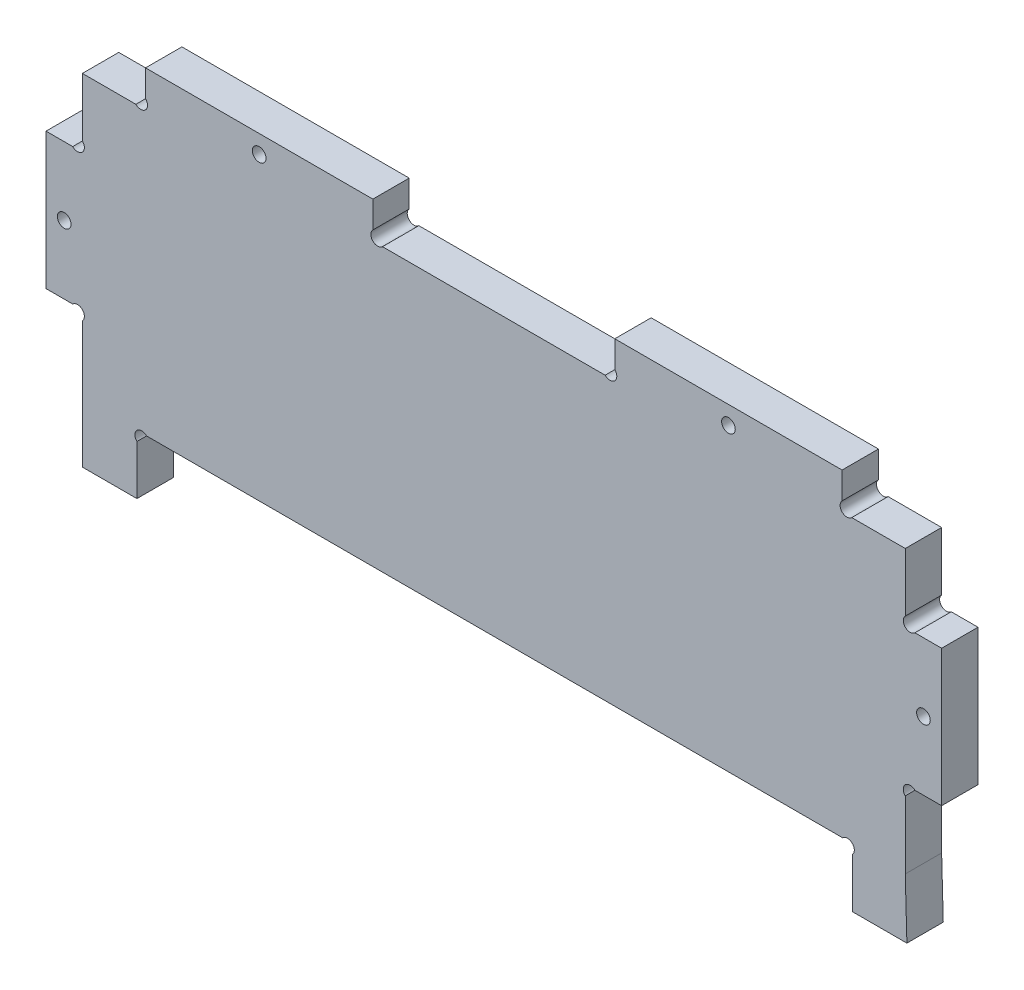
ISO-10303-21;
HEADER;
FILE_DESCRIPTION(('STEP AP214'),'2;1');
FILE_NAME('part.step','',(''),(''),'','','');
FILE_SCHEMA(('AUTOMOTIVE_DESIGN { 1 0 10303 214 1 1 1 1 }'));
ENDSEC;
DATA;
#1=APPLICATION_CONTEXT('core data for automotive mechanical design processes');
#2=APPLICATION_PROTOCOL_DEFINITION('international standard','automotive_design',2000,#1);
#3=PRODUCT_CONTEXT('',#1,'mechanical');
#4=PRODUCT('Part','Part','',(#3));
#5=PRODUCT_RELATED_PRODUCT_CATEGORY('part','',(#4));
#6=PRODUCT_DEFINITION_FORMATION('','',#4);
#7=PRODUCT_DEFINITION_CONTEXT('part definition',#1,'design');
#8=PRODUCT_DEFINITION('design','',#6,#7);
#9=PRODUCT_DEFINITION_SHAPE('','',#8);
#10=(LENGTH_UNIT() NAMED_UNIT(*) SI_UNIT(.MILLI.,.METRE.));
#11=(NAMED_UNIT(*) PLANE_ANGLE_UNIT() SI_UNIT($,.RADIAN.));
#12=(NAMED_UNIT(*) SI_UNIT($,.STERADIAN.) SOLID_ANGLE_UNIT());
#13=UNCERTAINTY_MEASURE_WITH_UNIT(LENGTH_MEASURE(1.E-05),#10,'distance_accuracy_value','');
#14=(GEOMETRIC_REPRESENTATION_CONTEXT(3) GLOBAL_UNCERTAINTY_ASSIGNED_CONTEXT((#13)) GLOBAL_UNIT_ASSIGNED_CONTEXT((#10,
#11,#12)) REPRESENTATION_CONTEXT('',''));
#15=CARTESIAN_POINT('',(0.,0.,0.));
#16=DIRECTION('',(0.,0.,1.));
#17=DIRECTION('',(1.,0.,0.));
#18=AXIS2_PLACEMENT_3D('',#15,#16,#17);
#19=CARTESIAN_POINT('',(136.240627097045,-37.5973711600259,8.));
#20=DIRECTION('',(0.,0.,1.));
#21=DIRECTION('',(1.,0.,0.));
#22=AXIS2_PLACEMENT_3D('',#19,#20,#21);
#23=PLANE('',#22);
#24=CARTESIAN_POINT('',(152.942499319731,-4.53671095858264,8.));
#25=DIRECTION('',(0.,0.,1.));
#26=DIRECTION('',(1.,0.,0.));
#27=AXIS2_PLACEMENT_3D('',#24,#25,#26);
#28=CIRCLE('',#27,1.49999999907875);
#29=CARTESIAN_POINT('',(154.442499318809,-4.53671095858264,8.));
#30=VERTEX_POINT('',#29);
#31=EDGE_CURVE('E590',#30,#30,#28,.T.);
#32=ORIENTED_EDGE('',*,*,#31,.F.);
#33=EDGE_LOOP('',(#32));
#34=FACE_BOUND('',#33,.T.);
#35=CARTESIAN_POINT('',(6.83564145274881,29.4632890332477,8.));
#36=DIRECTION('',(0.,0.,1.));
#37=DIRECTION('',(1.,0.,0.));
#38=AXIS2_PLACEMENT_3D('',#35,#36,#37);
#39=CIRCLE('',#38,1.5);
#40=CARTESIAN_POINT('',(8.33564145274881,29.4632890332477,8.));
#41=VERTEX_POINT('',#40);
#42=EDGE_CURVE('E295',#41,#41,#39,.T.);
#43=ORIENTED_EDGE('',*,*,#42,.F.);
#44=EDGE_LOOP('',(#43));
#45=FACE_BOUND('',#44,.T.);
#46=CARTESIAN_POINT('',(136.240627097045,-37.5973711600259,8.));
#47=DIRECTION('',(0.,0.,-1.));
#48=DIRECTION('',(1.,0.,0.));
#49=AXIS2_PLACEMENT_3D('',#46,#47,#48);
#50=CIRCLE('',#49,1.50000000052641);
#51=CARTESIAN_POINT('',(135.179966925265,-36.5367109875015,8.));
#52=VERTEX_POINT('',#51);
#53=CARTESIAN_POINT('',(137.301287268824,-38.6580313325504,8.));
#54=VERTEX_POINT('',#53);
#55=EDGE_CURVE('E361',#52,#54,#50,.T.);
#56=ORIENTED_EDGE('',*,*,#55,.T.);
#57=DIRECTION('',(0.,-1.,0.));
#58=VECTOR('',#57,1.);
#59=CARTESIAN_POINT('',(137.301287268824,-49.5367110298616,8.));
#60=LINE('',#59,#58);
#61=CARTESIAN_POINT('',(137.301287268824,-49.5367110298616,8.));
#62=VERTEX_POINT('',#61);
#63=EDGE_CURVE('E173',#54,#62,#60,.T.);
#64=ORIENTED_EDGE('',*,*,#63,.T.);
#65=DIRECTION('',(1.,0.,0.));
#66=VECTOR('',#65,1.);
#67=CARTESIAN_POINT('',(149.301287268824,-49.5367110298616,8.));
#68=LINE('',#67,#66);
#69=CARTESIAN_POINT('',(149.301287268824,-49.5367110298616,8.));
#70=VERTEX_POINT('',#69);
#71=EDGE_CURVE('E457',#62,#70,#68,.T.);
#72=ORIENTED_EDGE('',*,*,#71,.T.);
#73=DIRECTION('',(-0.0275885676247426,0.999619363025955,0.));
#74=VECTOR('',#73,1.);
#75=CARTESIAN_POINT('',(148.942499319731,-36.5367109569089,8.));
#76=LINE('',#75,#74);
#77=CARTESIAN_POINT('',(148.942499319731,-36.5367109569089,8.));
#78=VERTEX_POINT('',#77);
#79=EDGE_CURVE('E476',#70,#78,#76,.T.);
#80=ORIENTED_EDGE('',*,*,#79,.T.);
#81=DIRECTION('',(0.,1.,0.));
#82=VECTOR('',#81,1.);
#83=CARTESIAN_POINT('',(148.942499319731,-21.6580313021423,8.));
#84=LINE('',#83,#82);
#85=CARTESIAN_POINT('',(148.942499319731,-21.6580313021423,8.));
#86=VERTEX_POINT('',#85);
#87=EDGE_CURVE('E473',#78,#86,#84,.T.);
#88=ORIENTED_EDGE('',*,*,#87,.T.);
#89=CARTESIAN_POINT('',(150.003159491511,-20.5973711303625,8.));
#90=DIRECTION('',(0.,0.,-1.));
#91=DIRECTION('',(1.,0.,0.));
#92=AXIS2_PLACEMENT_3D('',#89,#90,#91);
#93=CIRCLE('',#92,1.50000000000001);
#94=CARTESIAN_POINT('',(151.06381966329,-19.5367109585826,8.));
#95=VERTEX_POINT('',#94);
#96=EDGE_CURVE('E475',#86,#95,#93,.T.);
#97=ORIENTED_EDGE('',*,*,#96,.T.);
#98=DIRECTION('',(1.,0.,0.));
#99=VECTOR('',#98,1.);
#100=CARTESIAN_POINT('',(156.942499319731,-19.5367109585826,8.));
#101=LINE('',#100,#99);
#102=CARTESIAN_POINT('',(156.942499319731,-19.5367109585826,8.));
#103=VERTEX_POINT('',#102);
#104=EDGE_CURVE('E478',#95,#103,#101,.T.);
#105=ORIENTED_EDGE('',*,*,#104,.T.);
#106=DIRECTION('',(0.,1.,0.));
#107=VECTOR('',#106,1.);
#108=CARTESIAN_POINT('',(156.942499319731,10.4632890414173,8.));
#109=LINE('',#108,#107);
#110=CARTESIAN_POINT('',(156.942499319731,10.4632890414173,8.));
#111=VERTEX_POINT('',#110);
#112=EDGE_CURVE('E484',#103,#111,#109,.T.);
#113=ORIENTED_EDGE('',*,*,#112,.T.);
#114=DIRECTION('',(-1.,0.,0.));
#115=VECTOR('',#114,1.);
#116=CARTESIAN_POINT('',(151.063819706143,10.4632890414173,8.));
#117=LINE('',#116,#115);
#118=CARTESIAN_POINT('',(151.063819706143,10.4632890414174,8.));
#119=VERTEX_POINT('',#118);
#120=EDGE_CURVE('E486',#111,#119,#117,.T.);
#121=ORIENTED_EDGE('',*,*,#120,.T.);
#122=CARTESIAN_POINT('',(150.003159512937,11.5239492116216,8.));
#123=DIRECTION('',(0.,0.,-1.));
#124=DIRECTION('',(1.,0.,0.));
#125=AXIS2_PLACEMENT_3D('',#122,#123,#124);
#126=CIRCLE('',#125,1.50000001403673);
#127=CARTESIAN_POINT('',(148.942499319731,12.5846093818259,8.));
#128=VERTEX_POINT('',#127);
#129=EDGE_CURVE('E488',#119,#128,#126,.T.);
#130=ORIENTED_EDGE('',*,*,#129,.T.);
#131=DIRECTION('',(0.,1.,0.));
#132=VECTOR('',#131,1.);
#133=CARTESIAN_POINT('',(148.942499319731,25.4632890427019,8.));
#134=LINE('',#133,#132);
#135=CARTESIAN_POINT('',(148.942499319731,25.4632890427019,8.));
#136=VERTEX_POINT('',#135);
#137=EDGE_CURVE('E490',#128,#136,#134,.T.);
#138=ORIENTED_EDGE('',*,*,#137,.T.);
#139=DIRECTION('',(-1.,0.,0.));
#140=VECTOR('',#139,1.);
#141=CARTESIAN_POINT('',(148.942499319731,25.4632890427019,8.));
#142=LINE('',#141,#140);
#143=CARTESIAN_POINT('',(137.170721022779,25.4632890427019,8.));
#144=VERTEX_POINT('',#143);
#145=EDGE_CURVE('E492',#136,#144,#142,.T.);
#146=ORIENTED_EDGE('',*,*,#145,.T.);
#147=CARTESIAN_POINT('',(136.110060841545,26.5239492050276,8.));
#148=DIRECTION('',(0.,0.,-1.));
#149=DIRECTION('',(1.,0.,0.));
#150=AXIS2_PLACEMENT_3D('',#147,#148,#149);
#151=CIRCLE('',#150,1.5);
#152=CARTESIAN_POINT('',(135.049400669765,27.5846093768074,8.));
#153=VERTEX_POINT('',#152);
#154=EDGE_CURVE('E494',#144,#153,#151,.T.);
#155=ORIENTED_EDGE('',*,*,#154,.T.);
#156=DIRECTION('',(0.,1.,0.));
#157=VECTOR('',#156,1.);
#158=CARTESIAN_POINT('',(135.049400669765,27.5846093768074,8.));
#159=LINE('',#158,#157);
#160=CARTESIAN_POINT('',(135.049400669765,33.4632890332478,8.));
#161=VERTEX_POINT('',#160);
#162=EDGE_CURVE('E496',#153,#161,#159,.T.);
#163=ORIENTED_EDGE('',*,*,#162,.T.);
#164=DIRECTION('',(-1.,0.,0.));
#165=VECTOR('',#164,1.);
#166=CARTESIAN_POINT('',(135.049400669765,33.4632890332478,8.));
#167=LINE('',#166,#165);
#168=CARTESIAN_POINT('',(85.0493167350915,33.4632890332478,8.));
#169=VERTEX_POINT('',#168);
#170=EDGE_CURVE('E498',#161,#169,#167,.T.);
#171=ORIENTED_EDGE('',*,*,#170,.T.);
#172=DIRECTION('',(0.,-1.,0.));
#173=VECTOR('',#172,1.);
#174=CARTESIAN_POINT('',(85.0493167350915,33.4632890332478,8.));
#175=LINE('',#174,#173);
#176=CARTESIAN_POINT('',(85.0493167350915,27.5846093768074,8.));
#177=VERTEX_POINT('',#176);
#178=EDGE_CURVE('E500',#169,#177,#175,.T.);
#179=ORIENTED_EDGE('',*,*,#178,.T.);
#180=CARTESIAN_POINT('',(83.9886565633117,26.5239492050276,8.));
#181=DIRECTION('',(0.,0.,-1.));
#182=DIRECTION('',(1.,0.,0.));
#183=AXIS2_PLACEMENT_3D('',#180,#181,#182);
#184=CIRCLE('',#183,1.5);
#185=CARTESIAN_POINT('',(82.9279963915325,25.4632890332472,8.));
#186=VERTEX_POINT('',#185);
#187=EDGE_CURVE('E502',#177,#186,#184,.T.);
#188=ORIENTED_EDGE('',*,*,#187,.T.);
#189=DIRECTION('',(-1.,0.,0.));
#190=VECTOR('',#189,1.);
#191=CARTESIAN_POINT('',(82.9279963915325,25.4632890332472,8.));
#192=LINE('',#191,#190);
#193=CARTESIAN_POINT('',(33.9570037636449,25.4632890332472,8.));
#194=VERTEX_POINT('',#193);
#195=EDGE_CURVE('E504',#186,#194,#192,.T.);
#196=ORIENTED_EDGE('',*,*,#195,.T.);
#197=CARTESIAN_POINT('',(32.8963435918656,26.5239492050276,8.));
#198=DIRECTION('',(0.,0.,-1.));
#199=DIRECTION('',(1.,0.,0.));
#200=AXIS2_PLACEMENT_3D('',#197,#198,#199);
#201=CIRCLE('',#200,1.50000000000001);
#202=CARTESIAN_POINT('',(31.8356834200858,27.5846093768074,8.));
#203=VERTEX_POINT('',#202);
#204=EDGE_CURVE('E506',#194,#203,#201,.T.);
#205=ORIENTED_EDGE('',*,*,#204,.T.);
#206=DIRECTION('',(0.,1.,0.));
#207=VECTOR('',#206,1.);
#208=CARTESIAN_POINT('',(31.8356834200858,27.5846093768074,8.));
#209=LINE('',#208,#207);
#210=CARTESIAN_POINT('',(31.8356834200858,33.4632890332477,8.));
#211=VERTEX_POINT('',#210);
#212=EDGE_CURVE('E508',#203,#211,#209,.T.);
#213=ORIENTED_EDGE('',*,*,#212,.T.);
#214=DIRECTION('',(-1.,0.,0.));
#215=VECTOR('',#214,1.);
#216=CARTESIAN_POINT('',(31.8356834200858,33.4632890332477,8.));
#217=LINE('',#216,#215);
#218=CARTESIAN_POINT('',(-18.1644005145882,33.4632890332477,8.));
#219=VERTEX_POINT('',#218);
#220=EDGE_CURVE('E510',#211,#219,#217,.T.);
#221=ORIENTED_EDGE('',*,*,#220,.T.);
#222=DIRECTION('',(0.,-1.,0.));
#223=VECTOR('',#222,1.);
#224=CARTESIAN_POINT('',(-18.1644005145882,33.4632890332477,8.));
#225=LINE('',#224,#223);
#226=CARTESIAN_POINT('',(-18.1644005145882,27.5846093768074,8.));
#227=VERTEX_POINT('',#226);
#228=EDGE_CURVE('E512',#219,#227,#225,.T.);
#229=ORIENTED_EDGE('',*,*,#228,.T.);
#230=CARTESIAN_POINT('',(-19.225060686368,26.5239492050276,8.));
#231=DIRECTION('',(0.,0.,-1.));
#232=DIRECTION('',(1.,0.,0.));
#233=AXIS2_PLACEMENT_3D('',#230,#231,#232);
#234=CIRCLE('',#233,1.5);
#235=CARTESIAN_POINT('',(-20.2857208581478,25.4632890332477,8.));
#236=VERTEX_POINT('',#235);
#237=EDGE_CURVE('E514',#227,#236,#234,.T.);
#238=ORIENTED_EDGE('',*,*,#237,.T.);
#239=DIRECTION('',(-1.,1.24144096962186E-10,0.));
#240=VECTOR('',#239,1.);
#241=CARTESIAN_POINT('',(-20.2857208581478,25.4632890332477,8.));
#242=LINE('',#241,#240);
#243=CARTESIAN_POINT('',(-32.0575006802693,25.4632890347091,8.));
#244=VERTEX_POINT('',#243);
#245=EDGE_CURVE('E516',#236,#244,#242,.T.);
#246=ORIENTED_EDGE('',*,*,#245,.T.);
#247=DIRECTION('',(0.,-1.,0.));
#248=VECTOR('',#247,1.);
#249=CARTESIAN_POINT('',(-32.0575006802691,12.5846093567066,8.));
#250=LINE('',#249,#248);
#251=CARTESIAN_POINT('',(-32.0575006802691,12.5846093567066,8.));
#252=VERTEX_POINT('',#251);
#253=EDGE_CURVE('E518',#244,#252,#250,.T.);
#254=ORIENTED_EDGE('',*,*,#253,.T.);
#255=CARTESIAN_POINT('',(-33.1181608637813,11.523949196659,8.));
#256=DIRECTION('',(0.,0.,-1.));
#257=DIRECTION('',(1.,0.,0.));
#258=AXIS2_PLACEMENT_3D('',#255,#256,#257);
#259=CIRCLE('',#258,1.50000000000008);
#260=CARTESIAN_POINT('',(-34.1788210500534,10.4632890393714,8.));
#261=VERTEX_POINT('',#260);
#262=EDGE_CURVE('E520',#252,#261,#259,.T.);
#263=ORIENTED_EDGE('',*,*,#262,.T.);
#264=DIRECTION('',(-1.,0.,0.));
#265=VECTOR('',#264,1.);
#266=CARTESIAN_POINT('',(-40.0575006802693,10.4632890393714,8.));
#267=LINE('',#266,#265);
#268=CARTESIAN_POINT('',(-40.0575006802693,10.4632890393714,8.));
#269=VERTEX_POINT('',#268);
#270=EDGE_CURVE('E522',#261,#269,#267,.T.);
#271=ORIENTED_EDGE('',*,*,#270,.T.);
#272=DIRECTION('',(0.,-1.,0.));
#273=VECTOR('',#272,1.);
#274=CARTESIAN_POINT('',(-40.0575006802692,-19.5367109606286,8.));
#275=LINE('',#274,#273);
#276=CARTESIAN_POINT('',(-40.0575006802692,-19.5367109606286,8.));
#277=VERTEX_POINT('',#276);
#278=EDGE_CURVE('E524',#269,#277,#275,.T.);
#279=ORIENTED_EDGE('',*,*,#278,.T.);
#280=DIRECTION('',(1.,0.,0.));
#281=VECTOR('',#280,1.);
#282=CARTESIAN_POINT('',(-34.1788210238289,-19.5367109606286,8.));
#283=LINE('',#282,#281);
#284=CARTESIAN_POINT('',(-34.1788210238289,-19.5367109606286,8.));
#285=VERTEX_POINT('',#284);
#286=EDGE_CURVE('E526',#277,#285,#283,.T.);
#287=ORIENTED_EDGE('',*,*,#286,.T.);
#288=CARTESIAN_POINT('',(-33.1181608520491,-20.5973711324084,8.));
#289=DIRECTION('',(0.,0.,-1.));
#290=DIRECTION('',(1.,0.,0.));
#291=AXIS2_PLACEMENT_3D('',#288,#289,#290);
#292=CIRCLE('',#291,1.5);
#293=CARTESIAN_POINT('',(-32.0575006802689,-21.6580313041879,8.));
#294=VERTEX_POINT('',#293);
#295=EDGE_CURVE('E528',#285,#294,#292,.T.);
#296=ORIENTED_EDGE('',*,*,#295,.T.);
#297=DIRECTION('',(0.,-1.,0.));
#298=VECTOR('',#297,1.);
#299=CARTESIAN_POINT('',(-32.0575006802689,-36.5367109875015,8.));
#300=LINE('',#299,#298);
#301=CARTESIAN_POINT('',(-32.0575006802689,-49.5367109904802,8.));
#302=VERTEX_POINT('',#301);
#303=EDGE_CURVE('E530',#294,#302,#300,.T.);
#304=ORIENTED_EDGE('',*,*,#303,.T.);
#305=DIRECTION('',(1.,0.,0.));
#306=VECTOR('',#305,1.);
#307=CARTESIAN_POINT('',(-32.0575006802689,-49.5367109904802,8.));
#308=LINE('',#307,#306);
#309=CARTESIAN_POINT('',(-20.0575006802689,-49.5367109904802,8.));
#310=VERTEX_POINT('',#309);
#311=EDGE_CURVE('E273',#302,#310,#308,.T.);
#312=ORIENTED_EDGE('',*,*,#311,.T.);
#313=DIRECTION('',(0.,1.,0.));
#314=VECTOR('',#313,1.);
#315=CARTESIAN_POINT('',(-20.0575006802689,-49.5367109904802,8.));
#316=LINE('',#315,#314);
#317=CARTESIAN_POINT('',(-20.0575006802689,-38.658031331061,8.));
#318=VERTEX_POINT('',#317);
#319=EDGE_CURVE('E267',#310,#318,#316,.T.);
#320=ORIENTED_EDGE('',*,*,#319,.T.);
#321=CARTESIAN_POINT('',(-18.996840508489,-37.5973711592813,8.));
#322=DIRECTION('',(0.,0.,-1.));
#323=DIRECTION('',(1.,0.,0.));
#324=AXIS2_PLACEMENT_3D('',#321,#322,#323);
#325=CIRCLE('',#324,1.5);
#326=CARTESIAN_POINT('',(-17.9361803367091,-36.5367109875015,8.));
#327=VERTEX_POINT('',#326);
#328=EDGE_CURVE('E271',#318,#327,#325,.T.);
#329=ORIENTED_EDGE('',*,*,#328,.T.);
#330=DIRECTION('',(1.,0.,0.));
#331=VECTOR('',#330,1.);
#332=CARTESIAN_POINT('',(-17.9361803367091,-36.5367109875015,8.));
#333=LINE('',#332,#331);
#334=EDGE_CURVE('E49',#327,#52,#333,.T.);
#335=ORIENTED_EDGE('',*,*,#334,.T.);
#336=EDGE_LOOP('',(#56,#64,#72,#80,#88,#97,#105,#113,#121,#130,#138,#146,#155,#163,#171,#179,
#188,#196,#205,#213,#221,#229,#238,#246,#254,#263,#271,#279,#287,#296,#304,#312,#320,#329,#335));
#337=FACE_BOUND('',#336,.T.);
#338=CARTESIAN_POINT('',(110.049358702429,29.4632890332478,8.));
#339=DIRECTION('',(0.,0.,1.));
#340=DIRECTION('',(1.,0.,0.));
#341=AXIS2_PLACEMENT_3D('',#338,#339,#340);
#342=CIRCLE('',#341,1.5);
#343=CARTESIAN_POINT('',(111.549358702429,29.4632890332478,8.));
#344=VERTEX_POINT('',#343);
#345=EDGE_CURVE('E596',#344,#344,#342,.T.);
#346=ORIENTED_EDGE('',*,*,#345,.F.);
#347=EDGE_LOOP('',(#346));
#348=FACE_BOUND('',#347,.T.);
#349=CARTESIAN_POINT('',(-36.0575006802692,-4.53671096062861,8.));
#350=DIRECTION('',(0.,0.,1.));
#351=DIRECTION('',(1.,0.,0.));
#352=AXIS2_PLACEMENT_3D('',#349,#350,#351);
#353=CIRCLE('',#352,1.49999999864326);
#354=CARTESIAN_POINT('',(-34.557500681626,-4.53671096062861,8.));
#355=VERTEX_POINT('',#354);
#356=EDGE_CURVE('E581',#355,#355,#353,.T.);
#357=ORIENTED_EDGE('',*,*,#356,.F.);
#358=EDGE_LOOP('',(#357));
#359=FACE_BOUND('',#358,.T.);
#360=ADVANCED_FACE('F32',(#34,#45,#337,#348,#359),#23,.T.);
#361=CARTESIAN_POINT('',(136.240627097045,-37.5973711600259,0.));
#362=DIRECTION('',(0.,0.,1.));
#363=DIRECTION('',(1.,0.,0.));
#364=AXIS2_PLACEMENT_3D('',#361,#362,#363);
#365=PLANE('',#364);
#366=CARTESIAN_POINT('',(152.942499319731,-4.53671095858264,0.));
#367=DIRECTION('',(0.,0.,1.));
#368=DIRECTION('',(1.,0.,0.));
#369=AXIS2_PLACEMENT_3D('',#366,#367,#368);
#370=CIRCLE('',#369,1.49999999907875);
#371=CARTESIAN_POINT('',(154.442499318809,-4.53671095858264,0.));
#372=VERTEX_POINT('',#371);
#373=EDGE_CURVE('E587',#372,#372,#370,.T.);
#374=ORIENTED_EDGE('',*,*,#373,.T.);
#375=EDGE_LOOP('',(#374));
#376=FACE_BOUND('',#375,.T.);
#377=CARTESIAN_POINT('',(6.83564145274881,29.4632890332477,0.));
#378=DIRECTION('',(0.,0.,1.));
#379=DIRECTION('',(1.,0.,0.));
#380=AXIS2_PLACEMENT_3D('',#377,#378,#379);
#381=CIRCLE('',#380,1.5);
#382=CARTESIAN_POINT('',(8.33564145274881,29.4632890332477,0.));
#383=VERTEX_POINT('',#382);
#384=EDGE_CURVE('E599',#383,#383,#381,.T.);
#385=ORIENTED_EDGE('',*,*,#384,.T.);
#386=EDGE_LOOP('',(#385));
#387=FACE_BOUND('',#386,.T.);
#388=CARTESIAN_POINT('',(136.240627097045,-37.5973711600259,0.));
#389=DIRECTION('',(0.,0.,-1.));
#390=DIRECTION('',(1.,0.,0.));
#391=AXIS2_PLACEMENT_3D('',#388,#389,#390);
#392=CIRCLE('',#391,1.50000000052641);
#393=CARTESIAN_POINT('',(135.179966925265,-36.5367109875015,0.));
#394=VERTEX_POINT('',#393);
#395=CARTESIAN_POINT('',(137.301287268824,-38.6580313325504,0.));
#396=VERTEX_POINT('',#395);
#397=EDGE_CURVE('E291',#394,#396,#392,.T.);
#398=ORIENTED_EDGE('',*,*,#397,.F.);
#399=DIRECTION('',(1.,0.,0.));
#400=VECTOR('',#399,1.);
#401=CARTESIAN_POINT('',(-17.9361803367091,-36.5367109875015,0.));
#402=LINE('',#401,#400);
#403=CARTESIAN_POINT('',(-17.9361803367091,-36.5367109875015,0.));
#404=VERTEX_POINT('',#403);
#405=EDGE_CURVE('E165',#404,#394,#402,.T.);
#406=ORIENTED_EDGE('',*,*,#405,.F.);
#407=CARTESIAN_POINT('',(-18.996840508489,-37.5973711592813,0.));
#408=DIRECTION('',(0.,0.,-1.));
#409=DIRECTION('',(1.,0.,0.));
#410=AXIS2_PLACEMENT_3D('',#407,#408,#409);
#411=CIRCLE('',#410,1.5);
#412=CARTESIAN_POINT('',(-20.0575006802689,-38.658031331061,0.));
#413=VERTEX_POINT('',#412);
#414=EDGE_CURVE('E159',#413,#404,#411,.T.);
#415=ORIENTED_EDGE('',*,*,#414,.F.);
#416=DIRECTION('',(0.,1.,0.));
#417=VECTOR('',#416,1.);
#418=CARTESIAN_POINT('',(-20.0575006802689,-49.5367109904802,0.));
#419=LINE('',#418,#417);
#420=CARTESIAN_POINT('',(-20.0575006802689,-49.5367109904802,0.));
#421=VERTEX_POINT('',#420);
#422=EDGE_CURVE('E281',#421,#413,#419,.T.);
#423=ORIENTED_EDGE('',*,*,#422,.F.);
#424=DIRECTION('',(1.,0.,0.));
#425=VECTOR('',#424,1.);
#426=CARTESIAN_POINT('',(-32.0575006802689,-49.5367109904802,0.));
#427=LINE('',#426,#425);
#428=CARTESIAN_POINT('',(-32.0575006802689,-49.5367109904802,0.));
#429=VERTEX_POINT('',#428);
#430=EDGE_CURVE('E356',#429,#421,#427,.T.);
#431=ORIENTED_EDGE('',*,*,#430,.F.);
#432=DIRECTION('',(0.,-1.,0.));
#433=VECTOR('',#432,1.);
#434=CARTESIAN_POINT('',(-32.0575006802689,-36.5367109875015,0.));
#435=LINE('',#434,#433);
#436=CARTESIAN_POINT('',(-32.0575006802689,-21.6580313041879,0.));
#437=VERTEX_POINT('',#436);
#438=EDGE_CURVE('E354',#437,#429,#435,.T.);
#439=ORIENTED_EDGE('',*,*,#438,.F.);
#440=CARTESIAN_POINT('',(-33.1181608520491,-20.5973711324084,0.));
#441=DIRECTION('',(0.,0.,-1.));
#442=DIRECTION('',(1.,0.,0.));
#443=AXIS2_PLACEMENT_3D('',#440,#441,#442);
#444=CIRCLE('',#443,1.5);
#445=CARTESIAN_POINT('',(-34.1788210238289,-19.5367109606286,0.));
#446=VERTEX_POINT('',#445);
#447=EDGE_CURVE('E351',#446,#437,#444,.T.);
#448=ORIENTED_EDGE('',*,*,#447,.F.);
#449=DIRECTION('',(1.,0.,0.));
#450=VECTOR('',#449,1.);
#451=CARTESIAN_POINT('',(-34.1788210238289,-19.5367109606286,0.));
#452=LINE('',#451,#450);
#453=CARTESIAN_POINT('',(-40.0575006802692,-19.5367109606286,0.));
#454=VERTEX_POINT('',#453);
#455=EDGE_CURVE('E349',#454,#446,#452,.T.);
#456=ORIENTED_EDGE('',*,*,#455,.F.);
#457=DIRECTION('',(0.,-1.,0.));
#458=VECTOR('',#457,1.);
#459=CARTESIAN_POINT('',(-40.0575006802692,-19.5367109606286,0.));
#460=LINE('',#459,#458);
#461=CARTESIAN_POINT('',(-40.0575006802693,10.4632890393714,0.));
#462=VERTEX_POINT('',#461);
#463=EDGE_CURVE('E347',#462,#454,#460,.T.);
#464=ORIENTED_EDGE('',*,*,#463,.F.);
#465=DIRECTION('',(-1.,0.,0.));
#466=VECTOR('',#465,1.);
#467=CARTESIAN_POINT('',(-40.0575006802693,10.4632890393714,0.));
#468=LINE('',#467,#466);
#469=CARTESIAN_POINT('',(-34.1788210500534,10.4632890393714,0.));
#470=VERTEX_POINT('',#469);
#471=EDGE_CURVE('E345',#470,#462,#468,.T.);
#472=ORIENTED_EDGE('',*,*,#471,.F.);
#473=CARTESIAN_POINT('',(-33.1181608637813,11.523949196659,0.));
#474=DIRECTION('',(0.,0.,-1.));
#475=DIRECTION('',(1.,0.,0.));
#476=AXIS2_PLACEMENT_3D('',#473,#474,#475);
#477=CIRCLE('',#476,1.50000000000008);
#478=CARTESIAN_POINT('',(-32.0575006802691,12.5846093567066,0.));
#479=VERTEX_POINT('',#478);
#480=EDGE_CURVE('E343',#479,#470,#477,.T.);
#481=ORIENTED_EDGE('',*,*,#480,.F.);
#482=DIRECTION('',(0.,-1.,0.));
#483=VECTOR('',#482,1.);
#484=CARTESIAN_POINT('',(-32.0575006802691,12.5846093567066,0.));
#485=LINE('',#484,#483);
#486=CARTESIAN_POINT('',(-32.0575006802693,25.4632890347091,0.));
#487=VERTEX_POINT('',#486);
#488=EDGE_CURVE('E341',#487,#479,#485,.T.);
#489=ORIENTED_EDGE('',*,*,#488,.F.);
#490=DIRECTION('',(-1.,1.24144096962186E-10,0.));
#491=VECTOR('',#490,1.);
#492=CARTESIAN_POINT('',(-20.2857208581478,25.4632890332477,0.));
#493=LINE('',#492,#491);
#494=CARTESIAN_POINT('',(-20.2857208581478,25.4632890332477,0.));
#495=VERTEX_POINT('',#494);
#496=EDGE_CURVE('E339',#495,#487,#493,.T.);
#497=ORIENTED_EDGE('',*,*,#496,.F.);
#498=CARTESIAN_POINT('',(-19.225060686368,26.5239492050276,0.));
#499=DIRECTION('',(0.,0.,-1.));
#500=DIRECTION('',(1.,0.,0.));
#501=AXIS2_PLACEMENT_3D('',#498,#499,#500);
#502=CIRCLE('',#501,1.5);
#503=CARTESIAN_POINT('',(-18.1644005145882,27.5846093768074,0.));
#504=VERTEX_POINT('',#503);
#505=EDGE_CURVE('E337',#504,#495,#502,.T.);
#506=ORIENTED_EDGE('',*,*,#505,.F.);
#507=DIRECTION('',(0.,-1.,0.));
#508=VECTOR('',#507,1.);
#509=CARTESIAN_POINT('',(-18.1644005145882,33.4632890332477,0.));
#510=LINE('',#509,#508);
#511=CARTESIAN_POINT('',(-18.1644005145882,33.4632890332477,0.));
#512=VERTEX_POINT('',#511);
#513=EDGE_CURVE('E335',#512,#504,#510,.T.);
#514=ORIENTED_EDGE('',*,*,#513,.F.);
#515=DIRECTION('',(-1.,0.,0.));
#516=VECTOR('',#515,1.);
#517=CARTESIAN_POINT('',(31.8356834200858,33.4632890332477,0.));
#518=LINE('',#517,#516);
#519=CARTESIAN_POINT('',(31.8356834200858,33.4632890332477,0.));
#520=VERTEX_POINT('',#519);
#521=EDGE_CURVE('E333',#520,#512,#518,.T.);
#522=ORIENTED_EDGE('',*,*,#521,.F.);
#523=DIRECTION('',(0.,1.,0.));
#524=VECTOR('',#523,1.);
#525=CARTESIAN_POINT('',(31.8356834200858,27.5846093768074,0.));
#526=LINE('',#525,#524);
#527=CARTESIAN_POINT('',(31.8356834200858,27.5846093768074,0.));
#528=VERTEX_POINT('',#527);
#529=EDGE_CURVE('E331',#528,#520,#526,.T.);
#530=ORIENTED_EDGE('',*,*,#529,.F.);
#531=CARTESIAN_POINT('',(32.8963435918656,26.5239492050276,0.));
#532=DIRECTION('',(0.,0.,-1.));
#533=DIRECTION('',(1.,0.,0.));
#534=AXIS2_PLACEMENT_3D('',#531,#532,#533);
#535=CIRCLE('',#534,1.50000000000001);
#536=CARTESIAN_POINT('',(33.9570037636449,25.4632890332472,0.));
#537=VERTEX_POINT('',#536);
#538=EDGE_CURVE('E329',#537,#528,#535,.T.);
#539=ORIENTED_EDGE('',*,*,#538,.F.);
#540=DIRECTION('',(-1.,0.,0.));
#541=VECTOR('',#540,1.);
#542=CARTESIAN_POINT('',(82.9279963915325,25.4632890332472,0.));
#543=LINE('',#542,#541);
#544=CARTESIAN_POINT('',(82.9279963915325,25.4632890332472,0.));
#545=VERTEX_POINT('',#544);
#546=EDGE_CURVE('E327',#545,#537,#543,.T.);
#547=ORIENTED_EDGE('',*,*,#546,.F.);
#548=CARTESIAN_POINT('',(83.9886565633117,26.5239492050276,0.));
#549=DIRECTION('',(0.,0.,-1.));
#550=DIRECTION('',(1.,0.,0.));
#551=AXIS2_PLACEMENT_3D('',#548,#549,#550);
#552=CIRCLE('',#551,1.5);
#553=CARTESIAN_POINT('',(85.0493167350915,27.5846093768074,0.));
#554=VERTEX_POINT('',#553);
#555=EDGE_CURVE('E325',#554,#545,#552,.T.);
#556=ORIENTED_EDGE('',*,*,#555,.F.);
#557=DIRECTION('',(0.,-1.,0.));
#558=VECTOR('',#557,1.);
#559=CARTESIAN_POINT('',(85.0493167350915,33.4632890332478,0.));
#560=LINE('',#559,#558);
#561=CARTESIAN_POINT('',(85.0493167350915,33.4632890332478,0.));
#562=VERTEX_POINT('',#561);
#563=EDGE_CURVE('E323',#562,#554,#560,.T.);
#564=ORIENTED_EDGE('',*,*,#563,.F.);
#565=DIRECTION('',(-1.,0.,0.));
#566=VECTOR('',#565,1.);
#567=CARTESIAN_POINT('',(135.049400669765,33.4632890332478,0.));
#568=LINE('',#567,#566);
#569=CARTESIAN_POINT('',(135.049400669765,33.4632890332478,0.));
#570=VERTEX_POINT('',#569);
#571=EDGE_CURVE('E321',#570,#562,#568,.T.);
#572=ORIENTED_EDGE('',*,*,#571,.F.);
#573=DIRECTION('',(0.,1.,0.));
#574=VECTOR('',#573,1.);
#575=CARTESIAN_POINT('',(135.049400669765,27.5846093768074,0.));
#576=LINE('',#575,#574);
#577=CARTESIAN_POINT('',(135.049400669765,27.5846093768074,0.));
#578=VERTEX_POINT('',#577);
#579=EDGE_CURVE('E319',#578,#570,#576,.T.);
#580=ORIENTED_EDGE('',*,*,#579,.F.);
#581=CARTESIAN_POINT('',(136.110060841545,26.5239492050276,0.));
#582=DIRECTION('',(0.,0.,-1.));
#583=DIRECTION('',(1.,0.,0.));
#584=AXIS2_PLACEMENT_3D('',#581,#582,#583);
#585=CIRCLE('',#584,1.5);
#586=CARTESIAN_POINT('',(137.170721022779,25.4632890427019,0.));
#587=VERTEX_POINT('',#586);
#588=EDGE_CURVE('E317',#587,#578,#585,.T.);
#589=ORIENTED_EDGE('',*,*,#588,.F.);
#590=DIRECTION('',(-1.,0.,0.));
#591=VECTOR('',#590,1.);
#592=CARTESIAN_POINT('',(148.942499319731,25.4632890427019,0.));
#593=LINE('',#592,#591);
#594=CARTESIAN_POINT('',(148.942499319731,25.4632890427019,0.));
#595=VERTEX_POINT('',#594);
#596=EDGE_CURVE('E315',#595,#587,#593,.T.);
#597=ORIENTED_EDGE('',*,*,#596,.F.);
#598=DIRECTION('',(0.,1.,0.));
#599=VECTOR('',#598,1.);
#600=CARTESIAN_POINT('',(148.942499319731,25.4632890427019,0.));
#601=LINE('',#600,#599);
#602=CARTESIAN_POINT('',(148.942499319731,12.5846093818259,0.));
#603=VERTEX_POINT('',#602);
#604=EDGE_CURVE('E313',#603,#595,#601,.T.);
#605=ORIENTED_EDGE('',*,*,#604,.F.);
#606=CARTESIAN_POINT('',(150.003159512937,11.5239492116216,0.));
#607=DIRECTION('',(0.,0.,-1.));
#608=DIRECTION('',(1.,0.,0.));
#609=AXIS2_PLACEMENT_3D('',#606,#607,#608);
#610=CIRCLE('',#609,1.50000001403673);
#611=CARTESIAN_POINT('',(151.063819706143,10.4632890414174,0.));
#612=VERTEX_POINT('',#611);
#613=EDGE_CURVE('E311',#612,#603,#610,.T.);
#614=ORIENTED_EDGE('',*,*,#613,.F.);
#615=DIRECTION('',(-1.,0.,0.));
#616=VECTOR('',#615,1.);
#617=CARTESIAN_POINT('',(151.063819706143,10.4632890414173,0.));
#618=LINE('',#617,#616);
#619=CARTESIAN_POINT('',(156.942499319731,10.4632890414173,0.));
#620=VERTEX_POINT('',#619);
#621=EDGE_CURVE('E309',#620,#612,#618,.T.);
#622=ORIENTED_EDGE('',*,*,#621,.F.);
#623=DIRECTION('',(0.,1.,0.));
#624=VECTOR('',#623,1.);
#625=CARTESIAN_POINT('',(156.942499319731,10.4632890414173,0.));
#626=LINE('',#625,#624);
#627=CARTESIAN_POINT('',(156.942499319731,-19.5367109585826,0.));
#628=VERTEX_POINT('',#627);
#629=EDGE_CURVE('E307',#628,#620,#626,.T.);
#630=ORIENTED_EDGE('',*,*,#629,.F.);
#631=DIRECTION('',(1.,0.,0.));
#632=VECTOR('',#631,1.);
#633=CARTESIAN_POINT('',(156.942499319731,-19.5367109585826,0.));
#634=LINE('',#633,#632);
#635=CARTESIAN_POINT('',(151.06381966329,-19.5367109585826,0.));
#636=VERTEX_POINT('',#635);
#637=EDGE_CURVE('E305',#636,#628,#634,.T.);
#638=ORIENTED_EDGE('',*,*,#637,.F.);
#639=CARTESIAN_POINT('',(150.003159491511,-20.5973711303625,0.));
#640=DIRECTION('',(0.,0.,-1.));
#641=DIRECTION('',(1.,0.,0.));
#642=AXIS2_PLACEMENT_3D('',#639,#640,#641);
#643=CIRCLE('',#642,1.50000000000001);
#644=CARTESIAN_POINT('',(148.942499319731,-21.6580313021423,0.));
#645=VERTEX_POINT('',#644);
#646=EDGE_CURVE('E303',#645,#636,#643,.T.);
#647=ORIENTED_EDGE('',*,*,#646,.F.);
#648=DIRECTION('',(0.,1.,0.));
#649=VECTOR('',#648,1.);
#650=CARTESIAN_POINT('',(148.942499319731,-21.6580313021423,0.));
#651=LINE('',#650,#649);
#652=CARTESIAN_POINT('',(148.942499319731,-36.5367109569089,0.));
#653=VERTEX_POINT('',#652);
#654=EDGE_CURVE('E301',#653,#645,#651,.T.);
#655=ORIENTED_EDGE('',*,*,#654,.F.);
#656=DIRECTION('',(-0.0275885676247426,0.999619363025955,0.));
#657=VECTOR('',#656,1.);
#658=CARTESIAN_POINT('',(148.942499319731,-36.5367109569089,0.));
#659=LINE('',#658,#657);
#660=CARTESIAN_POINT('',(149.301287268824,-49.5367110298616,0.));
#661=VERTEX_POINT('',#660);
#662=EDGE_CURVE('E299',#661,#653,#659,.T.);
#663=ORIENTED_EDGE('',*,*,#662,.F.);
#664=DIRECTION('',(1.,0.,0.));
#665=VECTOR('',#664,1.);
#666=CARTESIAN_POINT('',(149.301287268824,-49.5367110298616,0.));
#667=LINE('',#666,#665);
#668=CARTESIAN_POINT('',(137.301287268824,-49.5367110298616,0.));
#669=VERTEX_POINT('',#668);
#670=EDGE_CURVE('E297',#669,#661,#667,.T.);
#671=ORIENTED_EDGE('',*,*,#670,.F.);
#672=DIRECTION('',(0.,-1.,0.));
#673=VECTOR('',#672,1.);
#674=CARTESIAN_POINT('',(137.301287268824,-49.5367110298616,0.));
#675=LINE('',#674,#673);
#676=EDGE_CURVE('E294',#396,#669,#675,.T.);
#677=ORIENTED_EDGE('',*,*,#676,.F.);
#678=EDGE_LOOP('',(#398,#406,#415,#423,#431,#439,#448,#456,#464,#472,#481,#489,#497,#506,#514,
#522,#530,#539,#547,#556,#564,#572,#580,#589,#597,#605,#614,#622,#630,#638,#647,#655,#663,#671,#677));
#679=FACE_BOUND('',#678,.T.);
#680=CARTESIAN_POINT('',(110.049358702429,29.4632890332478,0.));
#681=DIRECTION('',(0.,0.,1.));
#682=DIRECTION('',(1.,0.,0.));
#683=AXIS2_PLACEMENT_3D('',#680,#681,#682);
#684=CIRCLE('',#683,1.5);
#685=CARTESIAN_POINT('',(111.549358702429,29.4632890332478,0.));
#686=VERTEX_POINT('',#685);
#687=EDGE_CURVE('E593',#686,#686,#684,.T.);
#688=ORIENTED_EDGE('',*,*,#687,.T.);
#689=EDGE_LOOP('',(#688));
#690=FACE_BOUND('',#689,.T.);
#691=CARTESIAN_POINT('',(-36.0575006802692,-4.53671096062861,0.));
#692=DIRECTION('',(0.,0.,1.));
#693=DIRECTION('',(1.,0.,0.));
#694=AXIS2_PLACEMENT_3D('',#691,#692,#693);
#695=CIRCLE('',#694,1.49999999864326);
#696=CARTESIAN_POINT('',(-34.557500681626,-4.53671096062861,0.));
#697=VERTEX_POINT('',#696);
#698=EDGE_CURVE('E584',#697,#697,#695,.T.);
#699=ORIENTED_EDGE('',*,*,#698,.T.);
#700=EDGE_LOOP('',(#699));
#701=FACE_BOUND('',#700,.T.);
#702=ADVANCED_FACE('F461',(#376,#387,#679,#690,#701),#365,.F.);
#703=CARTESIAN_POINT('',(136.240627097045,-37.5973711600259,8.));
#704=DIRECTION('',(0.,0.,-1.));
#705=DIRECTION('',(-1.,0.,0.));
#706=AXIS2_PLACEMENT_3D('',#703,#704,#705);
#707=CYLINDRICAL_SURFACE('',#706,1.50000000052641);
#708=ORIENTED_EDGE('',*,*,#397,.T.);
#709=DIRECTION('',(0.,0.,-1.));
#710=VECTOR('',#709,1.);
#711=CARTESIAN_POINT('',(137.301287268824,-38.6580313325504,8.));
#712=LINE('',#711,#710);
#713=EDGE_CURVE('E11',#54,#396,#712,.T.);
#714=ORIENTED_EDGE('',*,*,#713,.F.);
#715=ORIENTED_EDGE('',*,*,#55,.F.);
#716=DIRECTION('',(0.,0.,-1.));
#717=VECTOR('',#716,1.);
#718=CARTESIAN_POINT('',(135.179966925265,-36.5367109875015,8.));
#719=LINE('',#718,#717);
#720=EDGE_CURVE('E287',#52,#394,#719,.T.);
#721=ORIENTED_EDGE('',*,*,#720,.T.);
#722=EDGE_LOOP('',(#708,#714,#715,#721));
#723=FACE_BOUND('',#722,.T.);
#724=ADVANCED_FACE('F34',(#723),#707,.F.);
#725=CARTESIAN_POINT('',(137.301287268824,-49.5367110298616,8.));
#726=DIRECTION('',(1.,0.,0.));
#727=DIRECTION('',(0.,0.,-1.));
#728=AXIS2_PLACEMENT_3D('',#725,#726,#727);
#729=PLANE('',#728);
#730=ORIENTED_EDGE('',*,*,#676,.T.);
#731=DIRECTION('',(0.,0.,-1.));
#732=VECTOR('',#731,1.);
#733=CARTESIAN_POINT('',(137.301287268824,-49.5367110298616,8.));
#734=LINE('',#733,#732);
#735=EDGE_CURVE('E41',#62,#669,#734,.T.);
#736=ORIENTED_EDGE('',*,*,#735,.F.);
#737=ORIENTED_EDGE('',*,*,#63,.F.);
#738=ORIENTED_EDGE('',*,*,#713,.T.);
#739=EDGE_LOOP('',(#730,#736,#737,#738));
#740=FACE_BOUND('',#739,.T.);
#741=ADVANCED_FACE('F939',(#740),#729,.F.);
#742=CARTESIAN_POINT('',(149.301287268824,-49.5367110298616,8.));
#743=DIRECTION('',(0.,1.,0.));
#744=DIRECTION('',(-1.,0.,0.));
#745=AXIS2_PLACEMENT_3D('',#742,#743,#744);
#746=PLANE('',#745);
#747=ORIENTED_EDGE('',*,*,#670,.T.);
#748=DIRECTION('',(0.,0.,-1.));
#749=VECTOR('',#748,1.);
#750=CARTESIAN_POINT('',(149.301287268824,-49.5367110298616,8.));
#751=LINE('',#750,#749);
#752=EDGE_CURVE('E449',#70,#661,#751,.T.);
#753=ORIENTED_EDGE('',*,*,#752,.F.);
#754=ORIENTED_EDGE('',*,*,#71,.F.);
#755=ORIENTED_EDGE('',*,*,#735,.T.);
#756=EDGE_LOOP('',(#747,#753,#754,#755));
#757=FACE_BOUND('',#756,.T.);
#758=ADVANCED_FACE('F455',(#757),#746,.F.);
#759=CARTESIAN_POINT('',(148.942499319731,-36.5367109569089,8.));
#760=DIRECTION('',(-0.999619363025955,-0.0275885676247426,0.));
#761=DIRECTION('',(0.0275885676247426,-0.999619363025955,0.));
#762=AXIS2_PLACEMENT_3D('',#759,#760,#761);
#763=PLANE('',#762);
#764=ORIENTED_EDGE('',*,*,#662,.T.);
#765=DIRECTION('',(0.,0.,-1.));
#766=VECTOR('',#765,1.);
#767=CARTESIAN_POINT('',(148.942499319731,-36.5367109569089,8.));
#768=LINE('',#767,#766);
#769=EDGE_CURVE('E446',#78,#653,#768,.T.);
#770=ORIENTED_EDGE('',*,*,#769,.F.);
#771=ORIENTED_EDGE('',*,*,#79,.F.);
#772=ORIENTED_EDGE('',*,*,#752,.T.);
#773=EDGE_LOOP('',(#764,#770,#771,#772));
#774=FACE_BOUND('',#773,.T.);
#775=ADVANCED_FACE('F467',(#774),#763,.F.);
#776=CARTESIAN_POINT('',(148.942499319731,-21.6580313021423,8.));
#777=DIRECTION('',(-1.,0.,0.));
#778=DIRECTION('',(0.,0.,1.));
#779=AXIS2_PLACEMENT_3D('',#776,#777,#778);
#780=PLANE('',#779);
#781=ORIENTED_EDGE('',*,*,#654,.T.);
#782=DIRECTION('',(0.,0.,-1.));
#783=VECTOR('',#782,1.);
#784=CARTESIAN_POINT('',(148.942499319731,-21.6580313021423,8.));
#785=LINE('',#784,#783);
#786=EDGE_CURVE('E443',#86,#645,#785,.T.);
#787=ORIENTED_EDGE('',*,*,#786,.F.);
#788=ORIENTED_EDGE('',*,*,#87,.F.);
#789=ORIENTED_EDGE('',*,*,#769,.T.);
#790=EDGE_LOOP('',(#781,#787,#788,#789));
#791=FACE_BOUND('',#790,.T.);
#792=ADVANCED_FACE('F471',(#791),#780,.F.);
#793=CARTESIAN_POINT('',(150.003159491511,-20.5973711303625,8.));
#794=DIRECTION('',(0.,0.,-1.));
#795=DIRECTION('',(-1.,0.,0.));
#796=AXIS2_PLACEMENT_3D('',#793,#794,#795);
#797=CYLINDRICAL_SURFACE('',#796,1.50000000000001);
#798=ORIENTED_EDGE('',*,*,#646,.T.);
#799=DIRECTION('',(0.,0.,-1.));
#800=VECTOR('',#799,1.);
#801=CARTESIAN_POINT('',(151.06381966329,-19.5367109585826,8.));
#802=LINE('',#801,#800);
#803=EDGE_CURVE('E440',#95,#636,#802,.T.);
#804=ORIENTED_EDGE('',*,*,#803,.F.);
#805=ORIENTED_EDGE('',*,*,#96,.F.);
#806=ORIENTED_EDGE('',*,*,#786,.T.);
#807=EDGE_LOOP('',(#798,#804,#805,#806));
#808=FACE_BOUND('',#807,.T.);
#809=ADVANCED_FACE('F904',(#808),#797,.F.);
#810=CARTESIAN_POINT('',(156.942499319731,-19.5367109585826,8.));
#811=DIRECTION('',(0.,1.,0.));
#812=DIRECTION('',(-1.,0.,0.));
#813=AXIS2_PLACEMENT_3D('',#810,#811,#812);
#814=PLANE('',#813);
#815=ORIENTED_EDGE('',*,*,#637,.T.);
#816=DIRECTION('',(0.,0.,-1.));
#817=VECTOR('',#816,1.);
#818=CARTESIAN_POINT('',(156.942499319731,-19.5367109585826,8.));
#819=LINE('',#818,#817);
#820=EDGE_CURVE('E437',#103,#628,#819,.T.);
#821=ORIENTED_EDGE('',*,*,#820,.F.);
#822=ORIENTED_EDGE('',*,*,#104,.F.);
#823=ORIENTED_EDGE('',*,*,#803,.T.);
#824=EDGE_LOOP('',(#815,#821,#822,#823));
#825=FACE_BOUND('',#824,.T.);
#826=ADVANCED_FACE('F894',(#825),#814,.F.);
#827=CARTESIAN_POINT('',(156.942499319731,10.4632890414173,8.));
#828=DIRECTION('',(-1.,0.,0.));
#829=DIRECTION('',(0.,0.,1.));
#830=AXIS2_PLACEMENT_3D('',#827,#828,#829);
#831=PLANE('',#830);
#832=ORIENTED_EDGE('',*,*,#629,.T.);
#833=DIRECTION('',(0.,0.,-1.));
#834=VECTOR('',#833,1.);
#835=CARTESIAN_POINT('',(156.942499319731,10.4632890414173,8.));
#836=LINE('',#835,#834);
#837=EDGE_CURVE('E434',#111,#620,#836,.T.);
#838=ORIENTED_EDGE('',*,*,#837,.F.);
#839=ORIENTED_EDGE('',*,*,#112,.F.);
#840=ORIENTED_EDGE('',*,*,#820,.T.);
#841=EDGE_LOOP('',(#832,#838,#839,#840));
#842=FACE_BOUND('',#841,.T.);
#843=ADVANCED_FACE('F884',(#842),#831,.F.);
#844=CARTESIAN_POINT('',(151.063819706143,10.4632890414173,8.));
#845=DIRECTION('',(0.,-1.,0.));
#846=DIRECTION('',(0.,0.,-1.));
#847=AXIS2_PLACEMENT_3D('',#844,#845,#846);
#848=PLANE('',#847);
#849=ORIENTED_EDGE('',*,*,#621,.T.);
#850=DIRECTION('',(0.,0.,-1.));
#851=VECTOR('',#850,1.);
#852=CARTESIAN_POINT('',(151.063819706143,10.4632890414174,8.));
#853=LINE('',#852,#851);
#854=EDGE_CURVE('E431',#119,#612,#853,.T.);
#855=ORIENTED_EDGE('',*,*,#854,.F.);
#856=ORIENTED_EDGE('',*,*,#120,.F.);
#857=ORIENTED_EDGE('',*,*,#837,.T.);
#858=EDGE_LOOP('',(#849,#855,#856,#857));
#859=FACE_BOUND('',#858,.T.);
#860=ADVANCED_FACE('F874',(#859),#848,.F.);
#861=CARTESIAN_POINT('',(150.003159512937,11.5239492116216,8.));
#862=DIRECTION('',(0.,0.,-1.));
#863=DIRECTION('',(-1.,0.,0.));
#864=AXIS2_PLACEMENT_3D('',#861,#862,#863);
#865=CYLINDRICAL_SURFACE('',#864,1.50000001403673);
#866=ORIENTED_EDGE('',*,*,#613,.T.);
#867=DIRECTION('',(0.,0.,-1.));
#868=VECTOR('',#867,1.);
#869=CARTESIAN_POINT('',(148.942499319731,12.5846093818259,8.));
#870=LINE('',#869,#868);
#871=EDGE_CURVE('E428',#128,#603,#870,.T.);
#872=ORIENTED_EDGE('',*,*,#871,.F.);
#873=ORIENTED_EDGE('',*,*,#129,.F.);
#874=ORIENTED_EDGE('',*,*,#854,.T.);
#875=EDGE_LOOP('',(#866,#872,#873,#874));
#876=FACE_BOUND('',#875,.T.);
#877=ADVANCED_FACE('F864',(#876),#865,.F.);
#878=CARTESIAN_POINT('',(148.942499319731,25.4632890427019,8.));
#879=DIRECTION('',(-1.,0.,0.));
#880=DIRECTION('',(0.,0.,1.));
#881=AXIS2_PLACEMENT_3D('',#878,#879,#880);
#882=PLANE('',#881);
#883=ORIENTED_EDGE('',*,*,#604,.T.);
#884=DIRECTION('',(0.,0.,-1.));
#885=VECTOR('',#884,1.);
#886=CARTESIAN_POINT('',(148.942499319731,25.4632890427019,8.));
#887=LINE('',#886,#885);
#888=EDGE_CURVE('E425',#136,#595,#887,.T.);
#889=ORIENTED_EDGE('',*,*,#888,.F.);
#890=ORIENTED_EDGE('',*,*,#137,.F.);
#891=ORIENTED_EDGE('',*,*,#871,.T.);
#892=EDGE_LOOP('',(#883,#889,#890,#891));
#893=FACE_BOUND('',#892,.T.);
#894=ADVANCED_FACE('F854',(#893),#882,.F.);
#895=CARTESIAN_POINT('',(148.942499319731,25.4632890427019,8.));
#896=DIRECTION('',(0.,-1.,0.));
#897=DIRECTION('',(1.,0.,0.));
#898=AXIS2_PLACEMENT_3D('',#895,#896,#897);
#899=PLANE('',#898);
#900=ORIENTED_EDGE('',*,*,#596,.T.);
#901=DIRECTION('',(0.,0.,-1.));
#902=VECTOR('',#901,1.);
#903=CARTESIAN_POINT('',(137.170721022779,25.4632890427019,8.));
#904=LINE('',#903,#902);
#905=EDGE_CURVE('E422',#144,#587,#904,.T.);
#906=ORIENTED_EDGE('',*,*,#905,.F.);
#907=ORIENTED_EDGE('',*,*,#145,.F.);
#908=ORIENTED_EDGE('',*,*,#888,.T.);
#909=EDGE_LOOP('',(#900,#906,#907,#908));
#910=FACE_BOUND('',#909,.T.);
#911=ADVANCED_FACE('F844',(#910),#899,.F.);
#912=CARTESIAN_POINT('',(136.110060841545,26.5239492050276,8.));
#913=DIRECTION('',(0.,0.,-1.));
#914=DIRECTION('',(-1.,0.,0.));
#915=AXIS2_PLACEMENT_3D('',#912,#913,#914);
#916=CYLINDRICAL_SURFACE('',#915,1.5);
#917=ORIENTED_EDGE('',*,*,#588,.T.);
#918=DIRECTION('',(0.,0.,-1.));
#919=VECTOR('',#918,1.);
#920=CARTESIAN_POINT('',(135.049400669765,27.5846093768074,8.));
#921=LINE('',#920,#919);
#922=EDGE_CURVE('E419',#153,#578,#921,.T.);
#923=ORIENTED_EDGE('',*,*,#922,.F.);
#924=ORIENTED_EDGE('',*,*,#154,.F.);
#925=ORIENTED_EDGE('',*,*,#905,.T.);
#926=EDGE_LOOP('',(#917,#923,#924,#925));
#927=FACE_BOUND('',#926,.T.);
#928=ADVANCED_FACE('F834',(#927),#916,.F.);
#929=CARTESIAN_POINT('',(135.049400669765,27.5846093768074,8.));
#930=DIRECTION('',(-1.,0.,0.));
#931=DIRECTION('',(0.,0.,1.));
#932=AXIS2_PLACEMENT_3D('',#929,#930,#931);
#933=PLANE('',#932);
#934=ORIENTED_EDGE('',*,*,#579,.T.);
#935=DIRECTION('',(0.,0.,-1.));
#936=VECTOR('',#935,1.);
#937=CARTESIAN_POINT('',(135.049400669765,33.4632890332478,8.));
#938=LINE('',#937,#936);
#939=EDGE_CURVE('E416',#161,#570,#938,.T.);
#940=ORIENTED_EDGE('',*,*,#939,.F.);
#941=ORIENTED_EDGE('',*,*,#162,.F.);
#942=ORIENTED_EDGE('',*,*,#922,.T.);
#943=EDGE_LOOP('',(#934,#940,#941,#942));
#944=FACE_BOUND('',#943,.T.);
#945=ADVANCED_FACE('F824',(#944),#933,.F.);
#946=CARTESIAN_POINT('',(135.049400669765,33.4632890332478,8.));
#947=DIRECTION('',(0.,-1.,0.));
#948=DIRECTION('',(1.,0.,0.));
#949=AXIS2_PLACEMENT_3D('',#946,#947,#948);
#950=PLANE('',#949);
#951=ORIENTED_EDGE('',*,*,#571,.T.);
#952=DIRECTION('',(0.,0.,-1.));
#953=VECTOR('',#952,1.);
#954=CARTESIAN_POINT('',(85.0493167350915,33.4632890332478,8.));
#955=LINE('',#954,#953);
#956=EDGE_CURVE('E413',#169,#562,#955,.T.);
#957=ORIENTED_EDGE('',*,*,#956,.F.);
#958=ORIENTED_EDGE('',*,*,#170,.F.);
#959=ORIENTED_EDGE('',*,*,#939,.T.);
#960=EDGE_LOOP('',(#951,#957,#958,#959));
#961=FACE_BOUND('',#960,.T.);
#962=ADVANCED_FACE('F814',(#961),#950,.F.);
#963=CARTESIAN_POINT('',(85.0493167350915,33.4632890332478,8.));
#964=DIRECTION('',(1.,0.,0.));
#965=DIRECTION('',(0.,0.,-1.));
#966=AXIS2_PLACEMENT_3D('',#963,#964,#965);
#967=PLANE('',#966);
#968=ORIENTED_EDGE('',*,*,#563,.T.);
#969=DIRECTION('',(0.,0.,-1.));
#970=VECTOR('',#969,1.);
#971=CARTESIAN_POINT('',(85.0493167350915,27.5846093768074,8.));
#972=LINE('',#971,#970);
#973=EDGE_CURVE('E410',#177,#554,#972,.T.);
#974=ORIENTED_EDGE('',*,*,#973,.F.);
#975=ORIENTED_EDGE('',*,*,#178,.F.);
#976=ORIENTED_EDGE('',*,*,#956,.T.);
#977=EDGE_LOOP('',(#968,#974,#975,#976));
#978=FACE_BOUND('',#977,.T.);
#979=ADVANCED_FACE('F804',(#978),#967,.F.);
#980=CARTESIAN_POINT('',(83.9886565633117,26.5239492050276,8.));
#981=DIRECTION('',(0.,0.,-1.));
#982=DIRECTION('',(-1.,0.,0.));
#983=AXIS2_PLACEMENT_3D('',#980,#981,#982);
#984=CYLINDRICAL_SURFACE('',#983,1.5);
#985=ORIENTED_EDGE('',*,*,#555,.T.);
#986=DIRECTION('',(0.,0.,-1.));
#987=VECTOR('',#986,1.);
#988=CARTESIAN_POINT('',(82.9279963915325,25.4632890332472,8.));
#989=LINE('',#988,#987);
#990=EDGE_CURVE('E407',#186,#545,#989,.T.);
#991=ORIENTED_EDGE('',*,*,#990,.F.);
#992=ORIENTED_EDGE('',*,*,#187,.F.);
#993=ORIENTED_EDGE('',*,*,#973,.T.);
#994=EDGE_LOOP('',(#985,#991,#992,#993));
#995=FACE_BOUND('',#994,.T.);
#996=ADVANCED_FACE('F794',(#995),#984,.F.);
#997=CARTESIAN_POINT('',(82.9279963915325,25.4632890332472,8.));
#998=DIRECTION('',(0.,-1.,0.));
#999=DIRECTION('',(1.,0.,0.));
#1000=AXIS2_PLACEMENT_3D('',#997,#998,#999);
#1001=PLANE('',#1000);
#1002=ORIENTED_EDGE('',*,*,#546,.T.);
#1003=DIRECTION('',(0.,0.,-1.));
#1004=VECTOR('',#1003,1.);
#1005=CARTESIAN_POINT('',(33.9570037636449,25.4632890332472,8.));
#1006=LINE('',#1005,#1004);
#1007=EDGE_CURVE('E404',#194,#537,#1006,.T.);
#1008=ORIENTED_EDGE('',*,*,#1007,.F.);
#1009=ORIENTED_EDGE('',*,*,#195,.F.);
#1010=ORIENTED_EDGE('',*,*,#990,.T.);
#1011=EDGE_LOOP('',(#1002,#1008,#1009,#1010));
#1012=FACE_BOUND('',#1011,.T.);
#1013=ADVANCED_FACE('F784',(#1012),#1001,.F.);
#1014=CARTESIAN_POINT('',(32.8963435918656,26.5239492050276,8.));
#1015=DIRECTION('',(0.,0.,-1.));
#1016=DIRECTION('',(-1.,0.,0.));
#1017=AXIS2_PLACEMENT_3D('',#1014,#1015,#1016);
#1018=CYLINDRICAL_SURFACE('',#1017,1.50000000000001);
#1019=ORIENTED_EDGE('',*,*,#538,.T.);
#1020=DIRECTION('',(0.,0.,-1.));
#1021=VECTOR('',#1020,1.);
#1022=CARTESIAN_POINT('',(31.8356834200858,27.5846093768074,8.));
#1023=LINE('',#1022,#1021);
#1024=EDGE_CURVE('E401',#203,#528,#1023,.T.);
#1025=ORIENTED_EDGE('',*,*,#1024,.F.);
#1026=ORIENTED_EDGE('',*,*,#204,.F.);
#1027=ORIENTED_EDGE('',*,*,#1007,.T.);
#1028=EDGE_LOOP('',(#1019,#1025,#1026,#1027));
#1029=FACE_BOUND('',#1028,.T.);
#1030=ADVANCED_FACE('F774',(#1029),#1018,.F.);
#1031=CARTESIAN_POINT('',(31.8356834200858,27.5846093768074,8.));
#1032=DIRECTION('',(-1.,0.,0.));
#1033=DIRECTION('',(0.,-1.,0.));
#1034=AXIS2_PLACEMENT_3D('',#1031,#1032,#1033);
#1035=PLANE('',#1034);
#1036=ORIENTED_EDGE('',*,*,#529,.T.);
#1037=DIRECTION('',(0.,0.,-1.));
#1038=VECTOR('',#1037,1.);
#1039=CARTESIAN_POINT('',(31.8356834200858,33.4632890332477,8.));
#1040=LINE('',#1039,#1038);
#1041=EDGE_CURVE('E398',#211,#520,#1040,.T.);
#1042=ORIENTED_EDGE('',*,*,#1041,.F.);
#1043=ORIENTED_EDGE('',*,*,#212,.F.);
#1044=ORIENTED_EDGE('',*,*,#1024,.T.);
#1045=EDGE_LOOP('',(#1036,#1042,#1043,#1044));
#1046=FACE_BOUND('',#1045,.T.);
#1047=ADVANCED_FACE('F764',(#1046),#1035,.F.);
#1048=CARTESIAN_POINT('',(31.8356834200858,33.4632890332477,8.));
#1049=DIRECTION('',(0.,-1.,0.));
#1050=DIRECTION('',(1.,0.,0.));
#1051=AXIS2_PLACEMENT_3D('',#1048,#1049,#1050);
#1052=PLANE('',#1051);
#1053=ORIENTED_EDGE('',*,*,#521,.T.);
#1054=DIRECTION('',(0.,0.,-1.));
#1055=VECTOR('',#1054,1.);
#1056=CARTESIAN_POINT('',(-18.1644005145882,33.4632890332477,8.));
#1057=LINE('',#1056,#1055);
#1058=EDGE_CURVE('E395',#219,#512,#1057,.T.);
#1059=ORIENTED_EDGE('',*,*,#1058,.F.);
#1060=ORIENTED_EDGE('',*,*,#220,.F.);
#1061=ORIENTED_EDGE('',*,*,#1041,.T.);
#1062=EDGE_LOOP('',(#1053,#1059,#1060,#1061));
#1063=FACE_BOUND('',#1062,.T.);
#1064=ADVANCED_FACE('F754',(#1063),#1052,.F.);
#1065=CARTESIAN_POINT('',(-18.1644005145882,33.4632890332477,8.));
#1066=DIRECTION('',(1.,0.,0.));
#1067=DIRECTION('',(0.,0.,-1.));
#1068=AXIS2_PLACEMENT_3D('',#1065,#1066,#1067);
#1069=PLANE('',#1068);
#1070=ORIENTED_EDGE('',*,*,#513,.T.);
#1071=DIRECTION('',(0.,0.,-1.));
#1072=VECTOR('',#1071,1.);
#1073=CARTESIAN_POINT('',(-18.1644005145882,27.5846093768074,8.));
#1074=LINE('',#1073,#1072);
#1075=EDGE_CURVE('E392',#227,#504,#1074,.T.);
#1076=ORIENTED_EDGE('',*,*,#1075,.F.);
#1077=ORIENTED_EDGE('',*,*,#228,.F.);
#1078=ORIENTED_EDGE('',*,*,#1058,.T.);
#1079=EDGE_LOOP('',(#1070,#1076,#1077,#1078));
#1080=FACE_BOUND('',#1079,.T.);
#1081=ADVANCED_FACE('F744',(#1080),#1069,.F.);
#1082=CARTESIAN_POINT('',(-19.225060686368,26.5239492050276,8.));
#1083=DIRECTION('',(0.,0.,-1.));
#1084=DIRECTION('',(-1.,0.,0.));
#1085=AXIS2_PLACEMENT_3D('',#1082,#1083,#1084);
#1086=CYLINDRICAL_SURFACE('',#1085,1.5);
#1087=ORIENTED_EDGE('',*,*,#505,.T.);
#1088=DIRECTION('',(0.,0.,-1.));
#1089=VECTOR('',#1088,1.);
#1090=CARTESIAN_POINT('',(-20.2857208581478,25.4632890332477,8.));
#1091=LINE('',#1090,#1089);
#1092=EDGE_CURVE('E389',#236,#495,#1091,.T.);
#1093=ORIENTED_EDGE('',*,*,#1092,.F.);
#1094=ORIENTED_EDGE('',*,*,#237,.F.);
#1095=ORIENTED_EDGE('',*,*,#1075,.T.);
#1096=EDGE_LOOP('',(#1087,#1093,#1094,#1095));
#1097=FACE_BOUND('',#1096,.T.);
#1098=ADVANCED_FACE('F734',(#1097),#1086,.F.);
#1099=CARTESIAN_POINT('',(-20.2857208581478,25.4632890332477,8.));
#1100=DIRECTION('',(-1.24144096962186E-10,-1.,0.));
#1101=DIRECTION('',(1.,-1.24144096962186E-10,0.));
#1102=AXIS2_PLACEMENT_3D('',#1099,#1100,#1101);
#1103=PLANE('',#1102);
#1104=ORIENTED_EDGE('',*,*,#496,.T.);
#1105=DIRECTION('',(0.,0.,-1.));
#1106=VECTOR('',#1105,1.);
#1107=CARTESIAN_POINT('',(-32.0575006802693,25.4632890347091,8.));
#1108=LINE('',#1107,#1106);
#1109=EDGE_CURVE('E386',#244,#487,#1108,.T.);
#1110=ORIENTED_EDGE('',*,*,#1109,.F.);
#1111=ORIENTED_EDGE('',*,*,#245,.F.);
#1112=ORIENTED_EDGE('',*,*,#1092,.T.);
#1113=EDGE_LOOP('',(#1104,#1110,#1111,#1112));
#1114=FACE_BOUND('',#1113,.T.);
#1115=ADVANCED_FACE('F724',(#1114),#1103,.F.);
#1116=CARTESIAN_POINT('',(-32.0575006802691,12.5846093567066,8.));
#1117=DIRECTION('',(1.,0.,0.));
#1118=DIRECTION('',(0.,1.,0.));
#1119=AXIS2_PLACEMENT_3D('',#1116,#1117,#1118);
#1120=PLANE('',#1119);
#1121=ORIENTED_EDGE('',*,*,#488,.T.);
#1122=DIRECTION('',(0.,0.,-1.));
#1123=VECTOR('',#1122,1.);
#1124=CARTESIAN_POINT('',(-32.0575006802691,12.5846093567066,8.));
#1125=LINE('',#1124,#1123);
#1126=EDGE_CURVE('E383',#252,#479,#1125,.T.);
#1127=ORIENTED_EDGE('',*,*,#1126,.F.);
#1128=ORIENTED_EDGE('',*,*,#253,.F.);
#1129=ORIENTED_EDGE('',*,*,#1109,.T.);
#1130=EDGE_LOOP('',(#1121,#1127,#1128,#1129));
#1131=FACE_BOUND('',#1130,.T.);
#1132=ADVANCED_FACE('F714',(#1131),#1120,.F.);
#1133=CARTESIAN_POINT('',(-33.1181608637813,11.523949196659,8.));
#1134=DIRECTION('',(0.,0.,-1.));
#1135=DIRECTION('',(-1.,0.,0.));
#1136=AXIS2_PLACEMENT_3D('',#1133,#1134,#1135);
#1137=CYLINDRICAL_SURFACE('',#1136,1.50000000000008);
#1138=ORIENTED_EDGE('',*,*,#480,.T.);
#1139=DIRECTION('',(0.,0.,-1.));
#1140=VECTOR('',#1139,1.);
#1141=CARTESIAN_POINT('',(-34.1788210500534,10.4632890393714,8.));
#1142=LINE('',#1141,#1140);
#1143=EDGE_CURVE('E380',#261,#470,#1142,.T.);
#1144=ORIENTED_EDGE('',*,*,#1143,.F.);
#1145=ORIENTED_EDGE('',*,*,#262,.F.);
#1146=ORIENTED_EDGE('',*,*,#1126,.T.);
#1147=EDGE_LOOP('',(#1138,#1144,#1145,#1146));
#1148=FACE_BOUND('',#1147,.T.);
#1149=ADVANCED_FACE('F704',(#1148),#1137,.F.);
#1150=CARTESIAN_POINT('',(-40.0575006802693,10.4632890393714,8.));
#1151=DIRECTION('',(0.,-1.,0.));
#1152=DIRECTION('',(0.,0.,-1.));
#1153=AXIS2_PLACEMENT_3D('',#1150,#1151,#1152);
#1154=PLANE('',#1153);
#1155=ORIENTED_EDGE('',*,*,#471,.T.);
#1156=DIRECTION('',(0.,0.,-1.));
#1157=VECTOR('',#1156,1.);
#1158=CARTESIAN_POINT('',(-40.0575006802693,10.4632890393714,8.));
#1159=LINE('',#1158,#1157);
#1160=EDGE_CURVE('E377',#269,#462,#1159,.T.);
#1161=ORIENTED_EDGE('',*,*,#1160,.F.);
#1162=ORIENTED_EDGE('',*,*,#270,.F.);
#1163=ORIENTED_EDGE('',*,*,#1143,.T.);
#1164=EDGE_LOOP('',(#1155,#1161,#1162,#1163));
#1165=FACE_BOUND('',#1164,.T.);
#1166=ADVANCED_FACE('F694',(#1165),#1154,.F.);
#1167=CARTESIAN_POINT('',(-40.0575006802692,-19.5367109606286,8.));
#1168=DIRECTION('',(1.,0.,0.));
#1169=DIRECTION('',(0.,1.,0.));
#1170=AXIS2_PLACEMENT_3D('',#1167,#1168,#1169);
#1171=PLANE('',#1170);
#1172=ORIENTED_EDGE('',*,*,#463,.T.);
#1173=DIRECTION('',(0.,0.,-1.));
#1174=VECTOR('',#1173,1.);
#1175=CARTESIAN_POINT('',(-40.0575006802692,-19.5367109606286,8.));
#1176=LINE('',#1175,#1174);
#1177=EDGE_CURVE('E374',#277,#454,#1176,.T.);
#1178=ORIENTED_EDGE('',*,*,#1177,.F.);
#1179=ORIENTED_EDGE('',*,*,#278,.F.);
#1180=ORIENTED_EDGE('',*,*,#1160,.T.);
#1181=EDGE_LOOP('',(#1172,#1178,#1179,#1180));
#1182=FACE_BOUND('',#1181,.T.);
#1183=ADVANCED_FACE('F684',(#1182),#1171,.F.);
#1184=CARTESIAN_POINT('',(-34.1788210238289,-19.5367109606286,8.));
#1185=DIRECTION('',(0.,1.,0.));
#1186=DIRECTION('',(-1.,0.,0.));
#1187=AXIS2_PLACEMENT_3D('',#1184,#1185,#1186);
#1188=PLANE('',#1187);
#1189=ORIENTED_EDGE('',*,*,#455,.T.);
#1190=DIRECTION('',(0.,0.,-1.));
#1191=VECTOR('',#1190,1.);
#1192=CARTESIAN_POINT('',(-34.1788210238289,-19.5367109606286,8.));
#1193=LINE('',#1192,#1191);
#1194=EDGE_CURVE('E371',#285,#446,#1193,.T.);
#1195=ORIENTED_EDGE('',*,*,#1194,.F.);
#1196=ORIENTED_EDGE('',*,*,#286,.F.);
#1197=ORIENTED_EDGE('',*,*,#1177,.T.);
#1198=EDGE_LOOP('',(#1189,#1195,#1196,#1197));
#1199=FACE_BOUND('',#1198,.T.);
#1200=ADVANCED_FACE('F674',(#1199),#1188,.F.);
#1201=CARTESIAN_POINT('',(-33.1181608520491,-20.5973711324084,8.));
#1202=DIRECTION('',(0.,0.,-1.));
#1203=DIRECTION('',(-1.,0.,0.));
#1204=AXIS2_PLACEMENT_3D('',#1201,#1202,#1203);
#1205=CYLINDRICAL_SURFACE('',#1204,1.5);
#1206=ORIENTED_EDGE('',*,*,#447,.T.);
#1207=DIRECTION('',(0.,0.,-1.));
#1208=VECTOR('',#1207,1.);
#1209=CARTESIAN_POINT('',(-32.0575006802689,-21.6580313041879,8.));
#1210=LINE('',#1209,#1208);
#1211=EDGE_CURVE('E368',#294,#437,#1210,.T.);
#1212=ORIENTED_EDGE('',*,*,#1211,.F.);
#1213=ORIENTED_EDGE('',*,*,#295,.F.);
#1214=ORIENTED_EDGE('',*,*,#1194,.T.);
#1215=EDGE_LOOP('',(#1206,#1212,#1213,#1214));
#1216=FACE_BOUND('',#1215,.T.);
#1217=ADVANCED_FACE('F664',(#1216),#1205,.F.);
#1218=CARTESIAN_POINT('',(-32.0575006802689,-36.5367109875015,8.));
#1219=DIRECTION('',(1.,0.,0.));
#1220=DIRECTION('',(0.,0.,-1.));
#1221=AXIS2_PLACEMENT_3D('',#1218,#1219,#1220);
#1222=PLANE('',#1221);
#1223=ORIENTED_EDGE('',*,*,#438,.T.);
#1224=DIRECTION('',(0.,0.,-1.));
#1225=VECTOR('',#1224,1.);
#1226=CARTESIAN_POINT('',(-32.0575006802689,-49.5367109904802,8.));
#1227=LINE('',#1226,#1225);
#1228=EDGE_CURVE('E365',#302,#429,#1227,.T.);
#1229=ORIENTED_EDGE('',*,*,#1228,.F.);
#1230=ORIENTED_EDGE('',*,*,#303,.F.);
#1231=ORIENTED_EDGE('',*,*,#1211,.T.);
#1232=EDGE_LOOP('',(#1223,#1229,#1230,#1231));
#1233=FACE_BOUND('',#1232,.T.);
#1234=ADVANCED_FACE('F536',(#1233),#1222,.F.);
#1235=CARTESIAN_POINT('',(-32.0575006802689,-49.5367109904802,8.));
#1236=DIRECTION('',(0.,1.,0.));
#1237=DIRECTION('',(-1.,0.,0.));
#1238=AXIS2_PLACEMENT_3D('',#1235,#1236,#1237);
#1239=PLANE('',#1238);
#1240=ORIENTED_EDGE('',*,*,#430,.T.);
#1241=DIRECTION('',(0.,0.,-1.));
#1242=VECTOR('',#1241,1.);
#1243=CARTESIAN_POINT('',(-20.0575006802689,-49.5367109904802,8.));
#1244=LINE('',#1243,#1242);
#1245=EDGE_CURVE('E282',#310,#421,#1244,.T.);
#1246=ORIENTED_EDGE('',*,*,#1245,.F.);
#1247=ORIENTED_EDGE('',*,*,#311,.F.);
#1248=ORIENTED_EDGE('',*,*,#1228,.T.);
#1249=EDGE_LOOP('',(#1240,#1246,#1247,#1248));
#1250=FACE_BOUND('',#1249,.T.);
#1251=ADVANCED_FACE('F539',(#1250),#1239,.F.);
#1252=CARTESIAN_POINT('',(-20.0575006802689,-49.5367109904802,8.));
#1253=DIRECTION('',(-1.,0.,0.));
#1254=DIRECTION('',(0.,0.,1.));
#1255=AXIS2_PLACEMENT_3D('',#1252,#1253,#1254);
#1256=PLANE('',#1255);
#1257=ORIENTED_EDGE('',*,*,#422,.T.);
#1258=DIRECTION('',(0.,0.,-1.));
#1259=VECTOR('',#1258,1.);
#1260=CARTESIAN_POINT('',(-20.0575006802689,-38.658031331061,8.));
#1261=LINE('',#1260,#1259);
#1262=EDGE_CURVE('E278',#318,#413,#1261,.T.);
#1263=ORIENTED_EDGE('',*,*,#1262,.F.);
#1264=ORIENTED_EDGE('',*,*,#319,.F.);
#1265=ORIENTED_EDGE('',*,*,#1245,.T.);
#1266=EDGE_LOOP('',(#1257,#1263,#1264,#1265));
#1267=FACE_BOUND('',#1266,.T.);
#1268=ADVANCED_FACE('F279',(#1267),#1256,.F.);
#1269=CARTESIAN_POINT('',(-18.996840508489,-37.5973711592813,8.));
#1270=DIRECTION('',(0.,0.,-1.));
#1271=DIRECTION('',(-1.,0.,0.));
#1272=AXIS2_PLACEMENT_3D('',#1269,#1270,#1271);
#1273=CYLINDRICAL_SURFACE('',#1272,1.5);
#1274=ORIENTED_EDGE('',*,*,#414,.T.);
#1275=DIRECTION('',(0.,0.,-1.));
#1276=VECTOR('',#1275,1.);
#1277=CARTESIAN_POINT('',(-17.9361803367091,-36.5367109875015,8.));
#1278=LINE('',#1277,#1276);
#1279=EDGE_CURVE('E283',#327,#404,#1278,.T.);
#1280=ORIENTED_EDGE('',*,*,#1279,.F.);
#1281=ORIENTED_EDGE('',*,*,#328,.F.);
#1282=ORIENTED_EDGE('',*,*,#1262,.T.);
#1283=EDGE_LOOP('',(#1274,#1280,#1281,#1282));
#1284=FACE_BOUND('',#1283,.T.);
#1285=ADVANCED_FACE('F285',(#1284),#1273,.F.);
#1286=CARTESIAN_POINT('',(-17.9361803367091,-36.5367109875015,8.));
#1287=DIRECTION('',(0.,1.,0.));
#1288=DIRECTION('',(0.,0.,1.));
#1289=AXIS2_PLACEMENT_3D('',#1286,#1287,#1288);
#1290=PLANE('',#1289);
#1291=ORIENTED_EDGE('',*,*,#405,.T.);
#1292=ORIENTED_EDGE('',*,*,#720,.F.);
#1293=ORIENTED_EDGE('',*,*,#334,.F.);
#1294=ORIENTED_EDGE('',*,*,#1279,.T.);
#1295=EDGE_LOOP('',(#1291,#1292,#1293,#1294));
#1296=FACE_BOUND('',#1295,.T.);
#1297=ADVANCED_FACE('F543',(#1296),#1290,.F.);
#1298=CARTESIAN_POINT('',(6.83564145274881,29.4632890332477,8.));
#1299=DIRECTION('',(0.,0.,-1.));
#1300=DIRECTION('',(-1.,0.,0.));
#1301=AXIS2_PLACEMENT_3D('',#1298,#1299,#1300);
#1302=CYLINDRICAL_SURFACE('',#1301,1.5);
#1303=ORIENTED_EDGE('',*,*,#42,.T.);
#1304=EDGE_LOOP('',(#1303));
#1305=FACE_BOUND('',#1304,.T.);
#1306=ORIENTED_EDGE('',*,*,#384,.F.);
#1307=EDGE_LOOP('',(#1306));
#1308=FACE_BOUND('',#1307,.T.);
#1309=ADVANCED_FACE('F545',(#1305,#1308),#1302,.F.);
#1310=CARTESIAN_POINT('',(110.049358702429,29.4632890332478,8.));
#1311=DIRECTION('',(0.,0.,-1.));
#1312=DIRECTION('',(-1.,0.,0.));
#1313=AXIS2_PLACEMENT_3D('',#1310,#1311,#1312);
#1314=CYLINDRICAL_SURFACE('',#1313,1.5);
#1315=ORIENTED_EDGE('',*,*,#345,.T.);
#1316=EDGE_LOOP('',(#1315));
#1317=FACE_BOUND('',#1316,.T.);
#1318=ORIENTED_EDGE('',*,*,#687,.F.);
#1319=EDGE_LOOP('',(#1318));
#1320=FACE_BOUND('',#1319,.T.);
#1321=ADVANCED_FACE('F551',(#1317,#1320),#1314,.F.);
#1322=CARTESIAN_POINT('',(152.942499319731,-4.53671095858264,8.));
#1323=DIRECTION('',(0.,0.,-1.));
#1324=DIRECTION('',(-1.,0.,0.));
#1325=AXIS2_PLACEMENT_3D('',#1322,#1323,#1324);
#1326=CYLINDRICAL_SURFACE('',#1325,1.49999999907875);
#1327=ORIENTED_EDGE('',*,*,#31,.T.);
#1328=EDGE_LOOP('',(#1327));
#1329=FACE_BOUND('',#1328,.T.);
#1330=ORIENTED_EDGE('',*,*,#373,.F.);
#1331=EDGE_LOOP('',(#1330));
#1332=FACE_BOUND('',#1331,.T.);
#1333=ADVANCED_FACE('F568',(#1329,#1332),#1326,.F.);
#1334=CARTESIAN_POINT('',(-36.0575006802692,-4.53671096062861,8.));
#1335=DIRECTION('',(0.,0.,-1.));
#1336=DIRECTION('',(-1.,0.,0.));
#1337=AXIS2_PLACEMENT_3D('',#1334,#1335,#1336);
#1338=CYLINDRICAL_SURFACE('',#1337,1.49999999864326);
#1339=ORIENTED_EDGE('',*,*,#356,.T.);
#1340=EDGE_LOOP('',(#1339));
#1341=FACE_BOUND('',#1340,.T.);
#1342=ORIENTED_EDGE('',*,*,#698,.F.);
#1343=EDGE_LOOP('',(#1342));
#1344=FACE_BOUND('',#1343,.T.);
#1345=ADVANCED_FACE('F572',(#1341,#1344),#1338,.F.);
#1346=CLOSED_SHELL('',(#360,#702,#724,#741,#758,#775,#792,#809,#826,#843,#860,#877,#894,#911,
#928,#945,#962,#979,#996,#1013,#1030,#1047,#1064,#1081,#1098,#1115,#1132,#1149,#1166,#1183,
#1200,#1217,#1234,#1251,#1268,#1285,#1297,#1309,#1321,#1333,#1345));
#1347=MANIFOLD_SOLID_BREP('B2',#1346);
#1348=ADVANCED_BREP_SHAPE_REPRESENTATION('',(#18,#1347),#14);
#1349=SHAPE_DEFINITION_REPRESENTATION(#9,#1348);
ENDSEC;
END-ISO-10303-21;
